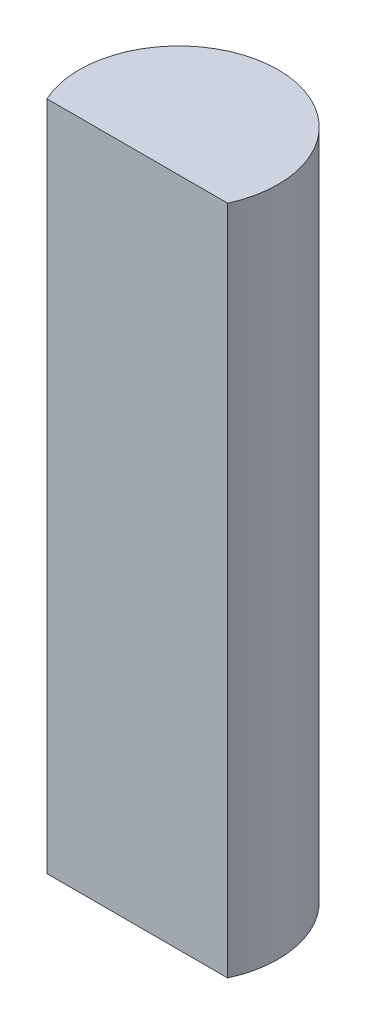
ISO-10303-21;
HEADER;
FILE_DESCRIPTION(('STEP AP214'),'2;1');
FILE_NAME('part.step','',(''),(''),'','','');
FILE_SCHEMA(('AUTOMOTIVE_DESIGN { 1 0 10303 214 1 1 1 1 }'));
ENDSEC;
DATA;
#1=APPLICATION_CONTEXT('core data for automotive mechanical design processes');
#2=APPLICATION_PROTOCOL_DEFINITION('international standard','automotive_design',2000,#1);
#3=PRODUCT_CONTEXT('',#1,'mechanical');
#4=PRODUCT('Part','Part','',(#3));
#5=PRODUCT_RELATED_PRODUCT_CATEGORY('part','',(#4));
#6=PRODUCT_DEFINITION_FORMATION('','',#4);
#7=PRODUCT_DEFINITION_CONTEXT('part definition',#1,'design');
#8=PRODUCT_DEFINITION('design','',#6,#7);
#9=PRODUCT_DEFINITION_SHAPE('','',#8);
#10=(LENGTH_UNIT() NAMED_UNIT(*) SI_UNIT(.MILLI.,.METRE.));
#11=(NAMED_UNIT(*) PLANE_ANGLE_UNIT() SI_UNIT($,.RADIAN.));
#12=(NAMED_UNIT(*) SI_UNIT($,.STERADIAN.) SOLID_ANGLE_UNIT());
#13=UNCERTAINTY_MEASURE_WITH_UNIT(LENGTH_MEASURE(1.E-05),#10,'distance_accuracy_value','');
#14=(GEOMETRIC_REPRESENTATION_CONTEXT(3) GLOBAL_UNCERTAINTY_ASSIGNED_CONTEXT((#13)) GLOBAL_UNIT_ASSIGNED_CONTEXT((#10,
#11,#12)) REPRESENTATION_CONTEXT('',''));
#15=CARTESIAN_POINT('',(0.,0.,0.));
#16=DIRECTION('',(0.,0.,1.));
#17=DIRECTION('',(1.,0.,0.));
#18=AXIS2_PLACEMENT_3D('',#15,#16,#17);
#19=CARTESIAN_POINT('',(0.,40.5,0.));
#20=DIRECTION('',(0.,-1.,0.));
#21=DIRECTION('',(0.,0.,-1.));
#22=AXIS2_PLACEMENT_3D('',#19,#20,#21);
#23=CYLINDRICAL_SURFACE('',#22,6.);
#24=CARTESIAN_POINT('',(0.,0.,0.));
#25=DIRECTION('',(0.,1.,0.));
#26=DIRECTION('',(0.,0.,-1.));
#27=AXIS2_PLACEMENT_3D('',#24,#25,#26);
#28=CIRCLE('',#27,6.);
#29=CARTESIAN_POINT('',(5.45435605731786,0.,2.5));
#30=VERTEX_POINT('',#29);
#31=CARTESIAN_POINT('',(-5.45435605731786,0.,2.5));
#32=VERTEX_POINT('',#31);
#33=EDGE_CURVE('E70',#30,#32,#28,.T.);
#34=ORIENTED_EDGE('',*,*,#33,.T.);
#35=DIRECTION('',(0.,-1.,0.));
#36=VECTOR('',#35,1.);
#37=CARTESIAN_POINT('',(-5.45435605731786,40.5,2.5));
#38=LINE('',#37,#36);
#39=CARTESIAN_POINT('',(-5.45435605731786,40.5,2.5));
#40=VERTEX_POINT('',#39);
#41=EDGE_CURVE('E11',#40,#32,#38,.T.);
#42=ORIENTED_EDGE('',*,*,#41,.F.);
#43=CARTESIAN_POINT('',(0.,40.5,0.));
#44=DIRECTION('',(0.,1.,0.));
#45=DIRECTION('',(0.,0.,-1.));
#46=AXIS2_PLACEMENT_3D('',#43,#44,#45);
#47=CIRCLE('',#46,6.);
#48=CARTESIAN_POINT('',(5.45435605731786,40.5,2.5));
#49=VERTEX_POINT('',#48);
#50=EDGE_CURVE('E69',#49,#40,#47,.T.);
#51=ORIENTED_EDGE('',*,*,#50,.F.);
#52=DIRECTION('',(0.,-1.,0.));
#53=VECTOR('',#52,1.);
#54=CARTESIAN_POINT('',(5.45435605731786,40.5,2.5));
#55=LINE('',#54,#53);
#56=EDGE_CURVE('E47',#49,#30,#55,.T.);
#57=ORIENTED_EDGE('',*,*,#56,.T.);
#58=EDGE_LOOP('',(#34,#42,#51,#57));
#59=FACE_BOUND('',#58,.T.);
#60=ADVANCED_FACE('F39',(#59),#23,.T.);
#61=CARTESIAN_POINT('',(-5.45435605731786,40.5,2.5));
#62=DIRECTION('',(0.,0.,-1.));
#63=DIRECTION('',(-1.,0.,0.));
#64=AXIS2_PLACEMENT_3D('',#61,#62,#63);
#65=PLANE('',#64);
#66=DIRECTION('',(1.,0.,0.));
#67=VECTOR('',#66,1.);
#68=CARTESIAN_POINT('',(-5.45435605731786,0.,2.5));
#69=LINE('',#68,#67);
#70=EDGE_CURVE('E62',#32,#30,#69,.T.);
#71=ORIENTED_EDGE('',*,*,#70,.T.);
#72=ORIENTED_EDGE('',*,*,#56,.F.);
#73=DIRECTION('',(1.,0.,0.));
#74=VECTOR('',#73,1.);
#75=CARTESIAN_POINT('',(-5.45435605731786,40.5,2.5));
#76=LINE('',#75,#74);
#77=EDGE_CURVE('E54',#40,#49,#76,.T.);
#78=ORIENTED_EDGE('',*,*,#77,.F.);
#79=ORIENTED_EDGE('',*,*,#41,.T.);
#80=EDGE_LOOP('',(#71,#72,#78,#79));
#81=FACE_BOUND('',#80,.T.);
#82=ADVANCED_FACE('F65',(#81),#65,.F.);
#83=CARTESIAN_POINT('',(0.,40.5,0.));
#84=DIRECTION('',(0.,-1.,0.));
#85=DIRECTION('',(0.,0.,-1.));
#86=AXIS2_PLACEMENT_3D('',#83,#84,#85);
#87=PLANE('',#86);
#88=ORIENTED_EDGE('',*,*,#50,.T.);
#89=ORIENTED_EDGE('',*,*,#77,.T.);
#90=EDGE_LOOP('',(#88,#89));
#91=FACE_BOUND('',#90,.T.);
#92=ADVANCED_FACE('F77',(#91),#87,.F.);
#93=CARTESIAN_POINT('',(0.,0.,0.));
#94=DIRECTION('',(0.,-1.,0.));
#95=DIRECTION('',(0.,0.,-1.));
#96=AXIS2_PLACEMENT_3D('',#93,#94,#95);
#97=PLANE('',#96);
#98=ORIENTED_EDGE('',*,*,#33,.F.);
#99=ORIENTED_EDGE('',*,*,#70,.F.);
#100=EDGE_LOOP('',(#98,#99));
#101=FACE_BOUND('',#100,.T.);
#102=ADVANCED_FACE('F73',(#101),#97,.T.);
#103=CLOSED_SHELL('',(#60,#82,#92,#102));
#104=MANIFOLD_SOLID_BREP('B2',#103);
#105=ADVANCED_BREP_SHAPE_REPRESENTATION('',(#18,#104),#14);
#106=SHAPE_DEFINITION_REPRESENTATION(#9,#105);
ENDSEC;
END-ISO-10303-21;
